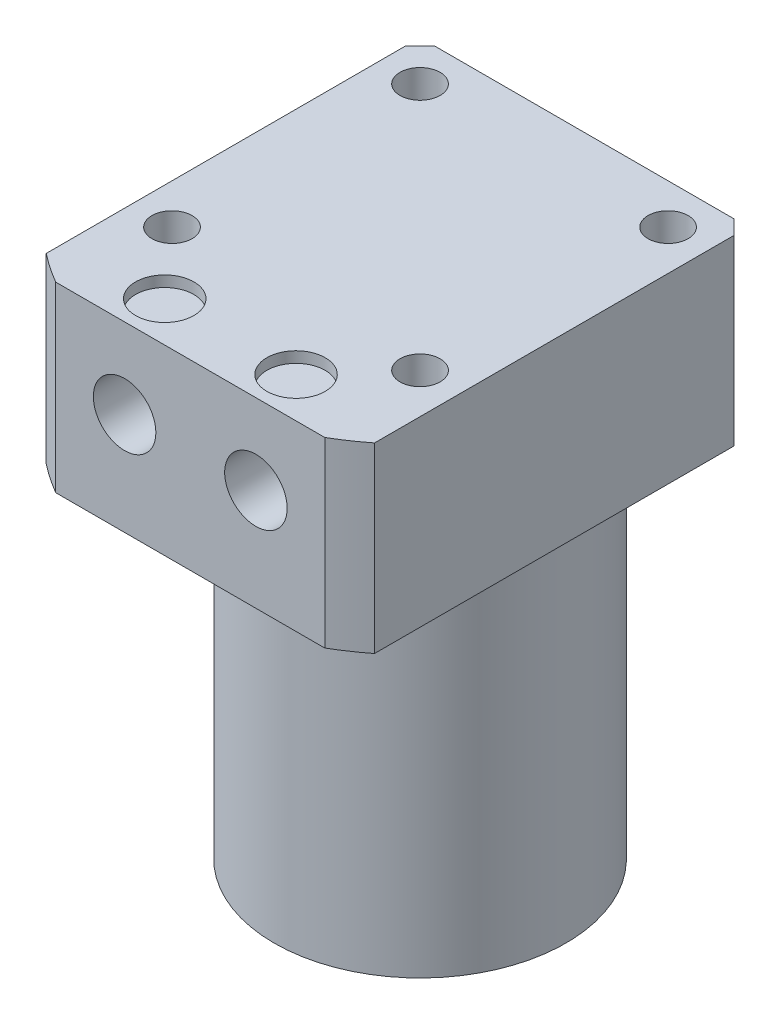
from build123d import *

# Parameters (mm, degrees)
SKETCH2_OUTSIDE_W              = 100.52
SKETCH2_OUTSIDE_H              = 100.52
SKETCH2_OUTSIDE_W_2            = 45
SKETCH2_OUTSIDE_H_2            = 54
CUT_EXTRUDE2_DEPTH             = 92.046691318
CHAMFER1_SIZE                  = 2
F_8_0_8_DIAMETER_HOLE1_D       = 8
F_8_0_8_DIAMETER_HOLE1_DEPTH   = 1.5
G1_8_TAPPED_HOLE1_D            = 8.566
G1_8_TAPPED_HOLE1_DEPTH        = 22.18
F_5_5_5_5_DIAMETER_HOLE1_D     = 5.5
F_5_5_5_5_DIAMETER_HOLE1_DEPTH = 31.5


with BuildPart() as part:
    # Sketch1 → Revolve1 (revolve)
    with BuildSketch(Plane.XY, mode=Mode.PRIVATE) as revolve1_sk:
        Polygon((0, 0), (-20, 0), (-20, 50), (-36.5, 50), (-36.5, 75), (0, 75), align=None)
    revolve(revolve1_sk.sketch.rotate(Axis((0, 87.050829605, 0), (0, -1, 0)), 270), axis=Axis((0, 87.050829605, 0), (0, -1, 0)))

    # Sketch2 outside → Cut-Extrude2 (cut, through all)
    with BuildSketch(Plane(origin=(0, 75, 0), x_dir=(1, 0, 0), z_dir=(0, 1, 0))):
        Rectangle(SKETCH2_OUTSIDE_W, SKETCH2_OUTSIDE_H)
        with Locations((0, -4.5)):
            Rectangle(SKETCH2_OUTSIDE_W_2, SKETCH2_OUTSIDE_H_2, mode=Mode.SUBTRACT)
    extrude(amount=-CUT_EXTRUDE2_DEPTH, mode=Mode.SUBTRACT)

    # Chamfer1
    chamfer1_edges = [part.edges().sort_by_distance(p)[0] for p in [
        (-22.5, 62.5, -22.5),
        (22.5, 62.5, -22.5),
    ]]
    chamfer(chamfer1_edges, length=CHAMFER1_SIZE)

    # 8.0 _8_ Diameter Hole1
    with Locations(Plane(origin=(-22.940510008, 75, 22.705104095), x_dir=(1, 0, 0), z_dir=(0, 1, 0))):
        with Locations((13.940510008, -3.294895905), (31.940510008, -3.294895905)):
            Hole(F_8_0_8_DIAMETER_HOLE1_D / 2, depth=F_8_0_8_DIAMETER_HOLE1_DEPTH)

    # G1_8 Tapped Hole1
    with Locations(Plane.XY.offset(31.5)):
        with Locations((-9, 64), (9, 64)):
            Hole(G1_8_TAPPED_HOLE1_D / 2, depth=G1_8_TAPPED_HOLE1_DEPTH)

    # 5.5 _5.5_ Diameter Hole1
    with Locations(Plane(origin=(-33.253495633, 50, 49.252389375), x_dir=(-1, 0, 0), z_dir=(0, -1, 0))):
        with Locations((-16.253495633, 66.252389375), (-50.253495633, 66.252389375), (-50.253495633, 32.252389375), (-16.253495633, 32.252389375)):
            Hole(F_5_5_5_5_DIAMETER_HOLE1_D / 2, depth=F_5_5_5_5_DIAMETER_HOLE1_DEPTH)


solid = part.part
